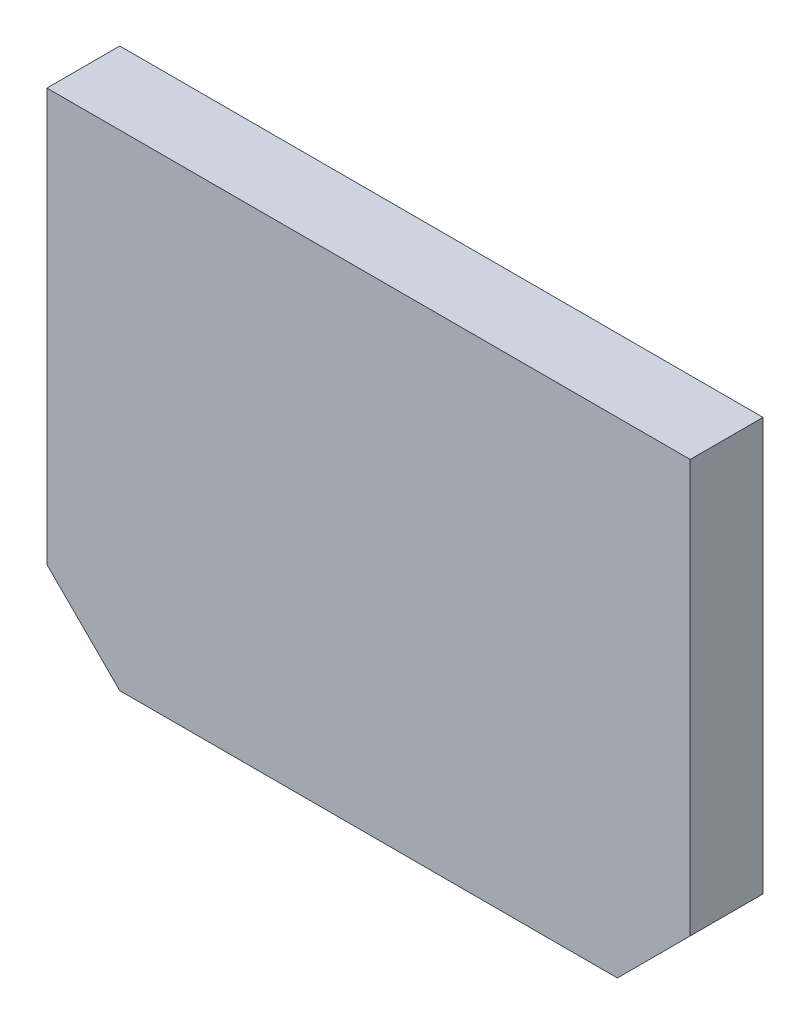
ISO-10303-21;
HEADER;
FILE_DESCRIPTION(('STEP AP214'),'2;1');
FILE_NAME('part.step','',(''),(''),'','','');
FILE_SCHEMA(('AUTOMOTIVE_DESIGN { 1 0 10303 214 1 1 1 1 }'));
ENDSEC;
DATA;
#1=APPLICATION_CONTEXT('core data for automotive mechanical design processes');
#2=APPLICATION_PROTOCOL_DEFINITION('international standard','automotive_design',2000,#1);
#3=PRODUCT_CONTEXT('',#1,'mechanical');
#4=PRODUCT('Part','Part','',(#3));
#5=PRODUCT_RELATED_PRODUCT_CATEGORY('part','',(#4));
#6=PRODUCT_DEFINITION_FORMATION('','',#4);
#7=PRODUCT_DEFINITION_CONTEXT('part definition',#1,'design');
#8=PRODUCT_DEFINITION('design','',#6,#7);
#9=PRODUCT_DEFINITION_SHAPE('','',#8);
#10=(LENGTH_UNIT() NAMED_UNIT(*) SI_UNIT(.MILLI.,.METRE.));
#11=(NAMED_UNIT(*) PLANE_ANGLE_UNIT() SI_UNIT($,.RADIAN.));
#12=(NAMED_UNIT(*) SI_UNIT($,.STERADIAN.) SOLID_ANGLE_UNIT());
#13=UNCERTAINTY_MEASURE_WITH_UNIT(LENGTH_MEASURE(1.E-05),#10,'distance_accuracy_value','');
#14=(GEOMETRIC_REPRESENTATION_CONTEXT(3) GLOBAL_UNCERTAINTY_ASSIGNED_CONTEXT((#13)) GLOBAL_UNIT_ASSIGNED_CONTEXT((#10,
#11,#12)) REPRESENTATION_CONTEXT('',''));
#15=CARTESIAN_POINT('',(0.,0.,0.));
#16=DIRECTION('',(0.,0.,1.));
#17=DIRECTION('',(1.,0.,0.));
#18=AXIS2_PLACEMENT_3D('',#15,#16,#17);
#19=CARTESIAN_POINT('',(0.,0.,6.00000000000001));
#20=DIRECTION('',(1.,0.,0.));
#21=DIRECTION('',(0.,0.,-1.));
#22=AXIS2_PLACEMENT_3D('',#19,#20,#21);
#23=PLANE('',#22);
#24=DIRECTION('',(0.,-1.,0.));
#25=VECTOR('',#24,1.);
#26=CARTESIAN_POINT('',(0.,0.,0.));
#27=LINE('',#26,#25);
#28=CARTESIAN_POINT('',(0.,40.,0.));
#29=VERTEX_POINT('',#28);
#30=CARTESIAN_POINT('',(0.,6.00000000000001,0.));
#31=VERTEX_POINT('',#30);
#32=EDGE_CURVE('E118',#29,#31,#27,.T.);
#33=ORIENTED_EDGE('',*,*,#32,.T.);
#34=DIRECTION('',(0.,0.,1.));
#35=VECTOR('',#34,1.);
#36=CARTESIAN_POINT('',(0.,6.00000000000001,6.00000000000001));
#37=LINE('',#36,#35);
#38=CARTESIAN_POINT('',(0.,6.00000000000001,6.00000000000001));
#39=VERTEX_POINT('',#38);
#40=EDGE_CURVE('E11',#31,#39,#37,.T.);
#41=ORIENTED_EDGE('',*,*,#40,.T.);
#42=DIRECTION('',(0.,-1.,0.));
#43=VECTOR('',#42,1.);
#44=CARTESIAN_POINT('',(0.,0.,6.00000000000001));
#45=LINE('',#44,#43);
#46=CARTESIAN_POINT('',(0.,40.,6.00000000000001));
#47=VERTEX_POINT('',#46);
#48=EDGE_CURVE('E119',#47,#39,#45,.T.);
#49=ORIENTED_EDGE('',*,*,#48,.F.);
#50=DIRECTION('',(0.,0.,-1.));
#51=VECTOR('',#50,1.);
#52=CARTESIAN_POINT('',(0.,40.,6.00000000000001));
#53=LINE('',#52,#51);
#54=EDGE_CURVE('E114',#47,#29,#53,.T.);
#55=ORIENTED_EDGE('',*,*,#54,.T.);
#56=EDGE_LOOP('',(#33,#41,#49,#55));
#57=FACE_BOUND('',#56,.T.);
#58=ADVANCED_FACE('F41',(#57),#23,.F.);
#59=CARTESIAN_POINT('',(0.,0.,6.00000000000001));
#60=DIRECTION('',(0.,1.,0.));
#61=DIRECTION('',(0.,0.,1.));
#62=AXIS2_PLACEMENT_3D('',#59,#60,#61);
#63=PLANE('',#62);
#64=DIRECTION('',(1.,0.,0.));
#65=VECTOR('',#64,1.);
#66=CARTESIAN_POINT('',(0.,0.,0.));
#67=LINE('',#66,#65);
#68=CARTESIAN_POINT('',(6.00000000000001,0.,0.));
#69=VERTEX_POINT('',#68);
#70=CARTESIAN_POINT('',(47.,0.,0.));
#71=VERTEX_POINT('',#70);
#72=EDGE_CURVE('E107',#69,#71,#67,.T.);
#73=ORIENTED_EDGE('',*,*,#72,.T.);
#74=DIRECTION('',(0.,0.,1.));
#75=VECTOR('',#74,1.);
#76=CARTESIAN_POINT('',(47.,0.,6.00000000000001));
#77=LINE('',#76,#75);
#78=CARTESIAN_POINT('',(47.,0.,6.00000000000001));
#79=VERTEX_POINT('',#78);
#80=EDGE_CURVE('E61',#71,#79,#77,.T.);
#81=ORIENTED_EDGE('',*,*,#80,.T.);
#82=DIRECTION('',(1.,0.,0.));
#83=VECTOR('',#82,1.);
#84=CARTESIAN_POINT('',(0.,0.,6.00000000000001));
#85=LINE('',#84,#83);
#86=CARTESIAN_POINT('',(6.00000000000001,0.,6.00000000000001));
#87=VERTEX_POINT('',#86);
#88=EDGE_CURVE('E121',#87,#79,#85,.T.);
#89=ORIENTED_EDGE('',*,*,#88,.F.);
#90=DIRECTION('',(0.,0.,-1.));
#91=VECTOR('',#90,1.);
#92=CARTESIAN_POINT('',(6.00000000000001,0.,6.00000000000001));
#93=LINE('',#92,#91);
#94=EDGE_CURVE('E135',#87,#69,#93,.T.);
#95=ORIENTED_EDGE('',*,*,#94,.T.);
#96=EDGE_LOOP('',(#73,#81,#89,#95));
#97=FACE_BOUND('',#96,.T.);
#98=ADVANCED_FACE('F146',(#97),#63,.F.);
#99=CARTESIAN_POINT('',(53.,0.,6.00000000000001));
#100=DIRECTION('',(-1.,0.,0.));
#101=DIRECTION('',(0.,0.,1.));
#102=AXIS2_PLACEMENT_3D('',#99,#100,#101);
#103=PLANE('',#102);
#104=DIRECTION('',(0.,1.,0.));
#105=VECTOR('',#104,1.);
#106=CARTESIAN_POINT('',(53.,0.,6.00000000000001));
#107=LINE('',#106,#105);
#108=CARTESIAN_POINT('',(53.,6.00000000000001,6.00000000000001));
#109=VERTEX_POINT('',#108);
#110=CARTESIAN_POINT('',(53.,40.,6.00000000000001));
#111=VERTEX_POINT('',#110);
#112=EDGE_CURVE('E126',#109,#111,#107,.T.);
#113=ORIENTED_EDGE('',*,*,#112,.F.);
#114=DIRECTION('',(0.,0.,-1.));
#115=VECTOR('',#114,1.);
#116=CARTESIAN_POINT('',(53.,6.00000000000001,6.00000000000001));
#117=LINE('',#116,#115);
#118=CARTESIAN_POINT('',(53.0000000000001,6.00000000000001,0.));
#119=VERTEX_POINT('',#118);
#120=EDGE_CURVE('E103',#109,#119,#117,.T.);
#121=ORIENTED_EDGE('',*,*,#120,.T.);
#122=DIRECTION('',(0.,1.,0.));
#123=VECTOR('',#122,1.);
#124=CARTESIAN_POINT('',(53.,0.,0.));
#125=LINE('',#124,#123);
#126=CARTESIAN_POINT('',(53.,40.,0.));
#127=VERTEX_POINT('',#126);
#128=EDGE_CURVE('E96',#119,#127,#125,.T.);
#129=ORIENTED_EDGE('',*,*,#128,.T.);
#130=DIRECTION('',(0.,0.,-1.));
#131=VECTOR('',#130,1.);
#132=CARTESIAN_POINT('',(53.,40.,6.00000000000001));
#133=LINE('',#132,#131);
#134=EDGE_CURVE('E100',#111,#127,#133,.T.);
#135=ORIENTED_EDGE('',*,*,#134,.F.);
#136=EDGE_LOOP('',(#113,#121,#129,#135));
#137=FACE_BOUND('',#136,.T.);
#138=ADVANCED_FACE('F99',(#137),#103,.F.);
#139=CARTESIAN_POINT('',(0.,40.,6.00000000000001));
#140=DIRECTION('',(0.,-1.,0.));
#141=DIRECTION('',(0.,0.,-1.));
#142=AXIS2_PLACEMENT_3D('',#139,#140,#141);
#143=PLANE('',#142);
#144=DIRECTION('',(-1.,0.,0.));
#145=VECTOR('',#144,1.);
#146=CARTESIAN_POINT('',(0.,40.,0.));
#147=LINE('',#146,#145);
#148=EDGE_CURVE('E106',#127,#29,#147,.T.);
#149=ORIENTED_EDGE('',*,*,#148,.T.);
#150=ORIENTED_EDGE('',*,*,#54,.F.);
#151=DIRECTION('',(-1.,0.,0.));
#152=VECTOR('',#151,1.);
#153=CARTESIAN_POINT('',(0.,40.,6.00000000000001));
#154=LINE('',#153,#152);
#155=EDGE_CURVE('E113',#111,#47,#154,.T.);
#156=ORIENTED_EDGE('',*,*,#155,.F.);
#157=ORIENTED_EDGE('',*,*,#134,.T.);
#158=EDGE_LOOP('',(#149,#150,#156,#157));
#159=FACE_BOUND('',#158,.T.);
#160=ADVANCED_FACE('F110',(#159),#143,.F.);
#161=CARTESIAN_POINT('',(0.,40.,6.00000000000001));
#162=DIRECTION('',(0.,0.,-1.));
#163=DIRECTION('',(-1.,0.,0.));
#164=AXIS2_PLACEMENT_3D('',#161,#162,#163);
#165=PLANE('',#164);
#166=ORIENTED_EDGE('',*,*,#88,.T.);
#167=DIRECTION('',(-0.707106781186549,-0.707106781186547,0.));
#168=VECTOR('',#167,1.);
#169=CARTESIAN_POINT('',(53.,6.00000000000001,6.00000000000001));
#170=LINE('',#169,#168);
#171=EDGE_CURVE('E48',#79,#109,#170,.F.);
#172=ORIENTED_EDGE('',*,*,#171,.T.);
#173=ORIENTED_EDGE('',*,*,#112,.T.);
#174=ORIENTED_EDGE('',*,*,#155,.T.);
#175=ORIENTED_EDGE('',*,*,#48,.T.);
#176=DIRECTION('',(-0.707106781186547,0.707106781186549,0.));
#177=VECTOR('',#176,1.);
#178=CARTESIAN_POINT('',(6.00000000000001,0.,6.00000000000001));
#179=LINE('',#178,#177);
#180=EDGE_CURVE('E139',#39,#87,#179,.F.);
#181=ORIENTED_EDGE('',*,*,#180,.T.);
#182=EDGE_LOOP('',(#166,#172,#173,#174,#175,#181));
#183=FACE_BOUND('',#182,.T.);
#184=ADVANCED_FACE('F142',(#183),#165,.F.);
#185=CARTESIAN_POINT('',(0.,40.,0.));
#186=DIRECTION('',(0.,0.,-1.));
#187=DIRECTION('',(-1.,0.,0.));
#188=AXIS2_PLACEMENT_3D('',#185,#186,#187);
#189=PLANE('',#188);
#190=ORIENTED_EDGE('',*,*,#128,.F.);
#191=DIRECTION('',(0.707106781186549,0.707106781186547,0.));
#192=VECTOR('',#191,1.);
#193=CARTESIAN_POINT('',(43.4999999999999,-3.50000000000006,0.));
#194=LINE('',#193,#192);
#195=EDGE_CURVE('E133',#119,#71,#194,.F.);
#196=ORIENTED_EDGE('',*,*,#195,.T.);
#197=ORIENTED_EDGE('',*,*,#72,.F.);
#198=DIRECTION('',(0.707106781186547,-0.707106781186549,0.));
#199=VECTOR('',#198,1.);
#200=CARTESIAN_POINT('',(-17.,23.,0.));
#201=LINE('',#200,#199);
#202=EDGE_CURVE('E131',#69,#31,#201,.F.);
#203=ORIENTED_EDGE('',*,*,#202,.T.);
#204=ORIENTED_EDGE('',*,*,#32,.F.);
#205=ORIENTED_EDGE('',*,*,#148,.F.);
#206=EDGE_LOOP('',(#190,#196,#197,#203,#204,#205));
#207=FACE_BOUND('',#206,.T.);
#208=ADVANCED_FACE('F117',(#207),#189,.T.);
#209=CARTESIAN_POINT('',(53.,6.00000000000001,6.00000000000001));
#210=DIRECTION('',(-0.707106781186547,0.707106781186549,0.));
#211=DIRECTION('',(-0.707106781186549,-0.707106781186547,0.));
#212=AXIS2_PLACEMENT_3D('',#209,#210,#211);
#213=PLANE('',#212);
#214=ORIENTED_EDGE('',*,*,#171,.F.);
#215=ORIENTED_EDGE('',*,*,#80,.F.);
#216=ORIENTED_EDGE('',*,*,#195,.F.);
#217=ORIENTED_EDGE('',*,*,#120,.F.);
#218=EDGE_LOOP('',(#214,#215,#216,#217));
#219=FACE_BOUND('',#218,.T.);
#220=ADVANCED_FACE('F144',(#219),#213,.F.);
#221=CARTESIAN_POINT('',(6.00000000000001,0.,6.00000000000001));
#222=DIRECTION('',(0.707106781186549,0.707106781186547,0.));
#223=DIRECTION('',(-0.707106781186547,0.707106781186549,0.));
#224=AXIS2_PLACEMENT_3D('',#221,#222,#223);
#225=PLANE('',#224);
#226=ORIENTED_EDGE('',*,*,#180,.F.);
#227=ORIENTED_EDGE('',*,*,#40,.F.);
#228=ORIENTED_EDGE('',*,*,#202,.F.);
#229=ORIENTED_EDGE('',*,*,#94,.F.);
#230=EDGE_LOOP('',(#226,#227,#228,#229));
#231=FACE_BOUND('',#230,.T.);
#232=ADVANCED_FACE('F151',(#231),#225,.F.);
#233=CLOSED_SHELL('',(#58,#98,#138,#160,#184,#208,#220,#232));
#234=MANIFOLD_SOLID_BREP('B2',#233);
#235=ADVANCED_BREP_SHAPE_REPRESENTATION('',(#18,#234),#14);
#236=SHAPE_DEFINITION_REPRESENTATION(#9,#235);
ENDSEC;
END-ISO-10303-21;
